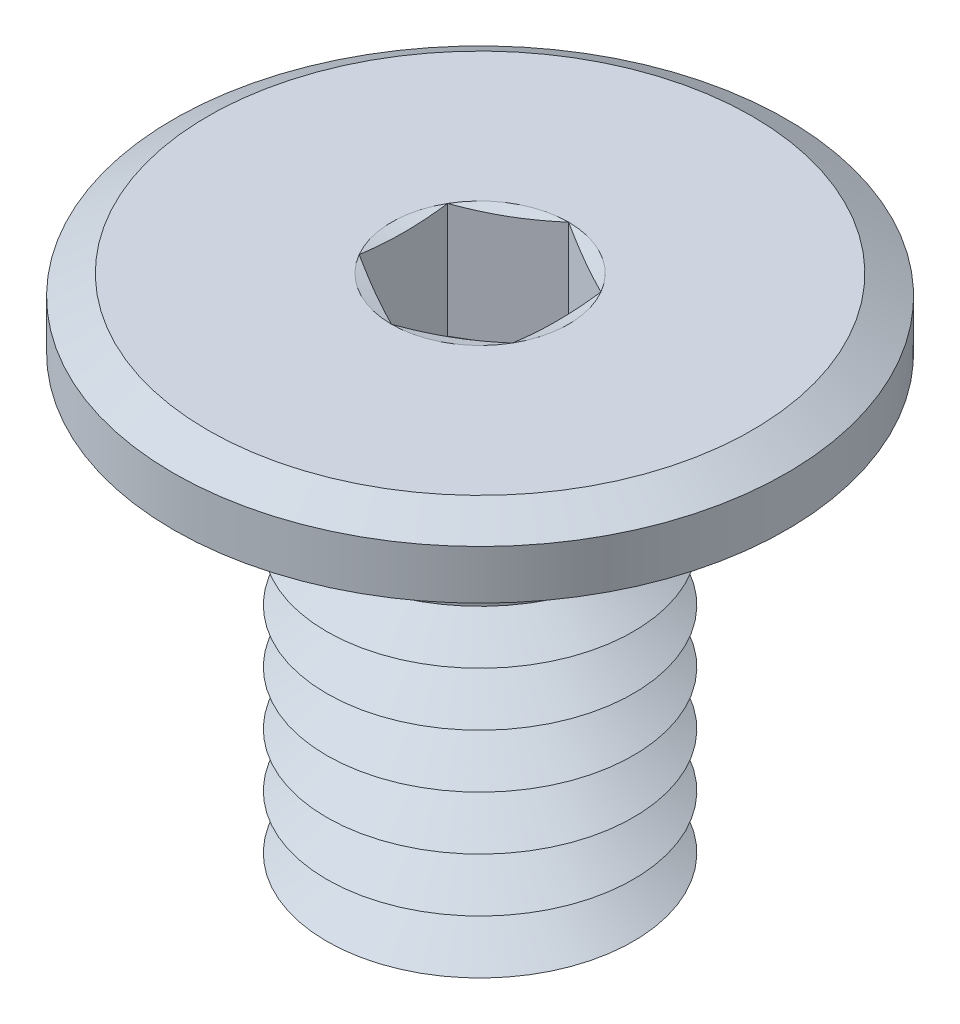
ISO-10303-21;
HEADER;
FILE_DESCRIPTION(('STEP AP214'),'2;1');
FILE_NAME('part.step','',(''),(''),'','','');
FILE_SCHEMA(('AUTOMOTIVE_DESIGN { 1 0 10303 214 1 1 1 1 }'));
ENDSEC;
DATA;
#1=APPLICATION_CONTEXT('core data for automotive mechanical design processes');
#2=APPLICATION_PROTOCOL_DEFINITION('international standard','automotive_design',2000,#1);
#3=PRODUCT_CONTEXT('',#1,'mechanical');
#4=PRODUCT('Part','Part','',(#3));
#5=PRODUCT_RELATED_PRODUCT_CATEGORY('part','',(#4));
#6=PRODUCT_DEFINITION_FORMATION('','',#4);
#7=PRODUCT_DEFINITION_CONTEXT('part definition',#1,'design');
#8=PRODUCT_DEFINITION('design','',#6,#7);
#9=PRODUCT_DEFINITION_SHAPE('','',#8);
#10=(LENGTH_UNIT() NAMED_UNIT(*) SI_UNIT(.MILLI.,.METRE.));
#11=(NAMED_UNIT(*) PLANE_ANGLE_UNIT() SI_UNIT($,.RADIAN.));
#12=(NAMED_UNIT(*) SI_UNIT($,.STERADIAN.) SOLID_ANGLE_UNIT());
#13=UNCERTAINTY_MEASURE_WITH_UNIT(LENGTH_MEASURE(1.E-05),#10,'distance_accuracy_value','');
#14=(GEOMETRIC_REPRESENTATION_CONTEXT(3) GLOBAL_UNCERTAINTY_ASSIGNED_CONTEXT((#13)) GLOBAL_UNIT_ASSIGNED_CONTEXT((#10,
#11,#12)) REPRESENTATION_CONTEXT('',''));
#15=CARTESIAN_POINT('',(0.,0.,0.));
#16=DIRECTION('',(0.,0.,1.));
#17=DIRECTION('',(1.,0.,0.));
#18=AXIS2_PLACEMENT_3D('',#15,#16,#17);
#19=CARTESIAN_POINT('',(0.,-5.85,0.));
#20=DIRECTION('',(0.,-1.,0.));
#21=DIRECTION('',(0.,0.,-1.));
#22=AXIS2_PLACEMENT_3D('',#19,#20,#21);
#23=CONICAL_SURFACE('',#22,2.,1.0471975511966);
#24=CARTESIAN_POINT('',(0.,-5.5,0.));
#25=DIRECTION('',(0.,1.,0.));
#26=DIRECTION('',(0.,0.,1.));
#27=AXIS2_PLACEMENT_3D('',#24,#25,#26);
#28=CIRCLE('',#27,1.39378221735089);
#29=CARTESIAN_POINT('',(0.,-5.5,1.39378221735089));
#30=VERTEX_POINT('',#29);
#31=EDGE_CURVE('E410',#30,#30,#28,.T.);
#32=ORIENTED_EDGE('',*,*,#31,.F.);
#33=EDGE_LOOP('',(#32));
#34=FACE_BOUND('',#33,.T.);
#35=CARTESIAN_POINT('',(0.,-5.85,0.));
#36=DIRECTION('',(0.,1.,0.));
#37=DIRECTION('',(0.,0.,1.));
#38=AXIS2_PLACEMENT_3D('',#35,#36,#37);
#39=CIRCLE('',#38,2.);
#40=CARTESIAN_POINT('',(0.,-5.85,2.));
#41=VERTEX_POINT('',#40);
#42=EDGE_CURVE('E414',#41,#41,#39,.T.);
#43=ORIENTED_EDGE('',*,*,#42,.T.);
#44=EDGE_LOOP('',(#43));
#45=FACE_BOUND('',#44,.T.);
#46=ADVANCED_FACE('F39',(#34,#45),#23,.T.);
#47=CARTESIAN_POINT('',(0.,-5.5,0.));
#48=DIRECTION('',(0.,1.,0.));
#49=DIRECTION('',(0.,0.,1.));
#50=AXIS2_PLACEMENT_3D('',#47,#48,#49);
#51=CONICAL_SURFACE('',#50,1.39378221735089,1.0471975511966);
#52=CARTESIAN_POINT('',(0.,-5.15,0.));
#53=DIRECTION('',(0.,1.,0.));
#54=DIRECTION('',(0.,0.,1.));
#55=AXIS2_PLACEMENT_3D('',#52,#53,#54);
#56=CIRCLE('',#55,2.);
#57=CARTESIAN_POINT('',(0.,-5.15,2.));
#58=VERTEX_POINT('',#57);
#59=EDGE_CURVE('E406',#58,#58,#56,.T.);
#60=ORIENTED_EDGE('',*,*,#59,.F.);
#61=EDGE_LOOP('',(#60));
#62=FACE_BOUND('',#61,.T.);
#63=ORIENTED_EDGE('',*,*,#31,.T.);
#64=EDGE_LOOP('',(#63));
#65=FACE_BOUND('',#64,.T.);
#66=ADVANCED_FACE('F233',(#62,#65),#51,.T.);
#67=CARTESIAN_POINT('',(0.,-6.9,0.));
#68=DIRECTION('',(0.,-1.,0.));
#69=DIRECTION('',(0.,0.,-1.));
#70=AXIS2_PLACEMENT_3D('',#67,#68,#69);
#71=PLANE('',#70);
#72=CARTESIAN_POINT('',(0.,-6.9,0.));
#73=DIRECTION('',(0.,1.,0.));
#74=DIRECTION('',(0.,0.,1.));
#75=AXIS2_PLACEMENT_3D('',#72,#73,#74);
#76=CIRCLE('',#75,1.39378221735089);
#77=CARTESIAN_POINT('',(0.,-6.9,1.39378221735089));
#78=VERTEX_POINT('',#77);
#79=EDGE_CURVE('E299',#78,#78,#76,.T.);
#80=ORIENTED_EDGE('',*,*,#79,.F.);
#81=EDGE_LOOP('',(#80));
#82=FACE_BOUND('',#81,.T.);
#83=ADVANCED_FACE('F239',(#82),#71,.T.);
#84=CARTESIAN_POINT('',(0.,-6.9,0.));
#85=DIRECTION('',(0.,1.,0.));
#86=DIRECTION('',(0.,0.,1.));
#87=AXIS2_PLACEMENT_3D('',#84,#85,#86);
#88=CONICAL_SURFACE('',#87,1.39378221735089,1.0471975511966);
#89=CARTESIAN_POINT('',(0.,-6.55,0.));
#90=DIRECTION('',(0.,1.,0.));
#91=DIRECTION('',(0.,0.,1.));
#92=AXIS2_PLACEMENT_3D('',#89,#90,#91);
#93=CIRCLE('',#92,2.);
#94=CARTESIAN_POINT('',(0.,-6.55,2.));
#95=VERTEX_POINT('',#94);
#96=EDGE_CURVE('E422',#95,#95,#93,.T.);
#97=ORIENTED_EDGE('',*,*,#96,.F.);
#98=EDGE_LOOP('',(#97));
#99=FACE_BOUND('',#98,.T.);
#100=ORIENTED_EDGE('',*,*,#79,.T.);
#101=EDGE_LOOP('',(#100));
#102=FACE_BOUND('',#101,.T.);
#103=ADVANCED_FACE('F254',(#99,#102),#88,.T.);
#104=CARTESIAN_POINT('',(0.,-6.55,0.));
#105=DIRECTION('',(0.,-1.,0.));
#106=DIRECTION('',(0.,0.,-1.));
#107=AXIS2_PLACEMENT_3D('',#104,#105,#106);
#108=CONICAL_SURFACE('',#107,2.,1.0471975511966);
#109=CARTESIAN_POINT('',(0.,-6.2,0.));
#110=DIRECTION('',(0.,1.,0.));
#111=DIRECTION('',(0.,0.,1.));
#112=AXIS2_PLACEMENT_3D('',#109,#110,#111);
#113=CIRCLE('',#112,1.39378221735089);
#114=CARTESIAN_POINT('',(0.,-6.2,1.39378221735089));
#115=VERTEX_POINT('',#114);
#116=EDGE_CURVE('E418',#115,#115,#113,.T.);
#117=ORIENTED_EDGE('',*,*,#116,.F.);
#118=EDGE_LOOP('',(#117));
#119=FACE_BOUND('',#118,.T.);
#120=ORIENTED_EDGE('',*,*,#96,.T.);
#121=EDGE_LOOP('',(#120));
#122=FACE_BOUND('',#121,.T.);
#123=ADVANCED_FACE('F250',(#119,#122),#108,.T.);
#124=CARTESIAN_POINT('',(0.,-6.2,0.));
#125=DIRECTION('',(0.,1.,0.));
#126=DIRECTION('',(0.,0.,1.));
#127=AXIS2_PLACEMENT_3D('',#124,#125,#126);
#128=CONICAL_SURFACE('',#127,1.39378221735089,1.0471975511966);
#129=ORIENTED_EDGE('',*,*,#42,.F.);
#130=EDGE_LOOP('',(#129));
#131=FACE_BOUND('',#130,.T.);
#132=ORIENTED_EDGE('',*,*,#116,.T.);
#133=EDGE_LOOP('',(#132));
#134=FACE_BOUND('',#133,.T.);
#135=ADVANCED_FACE('F246',(#131,#134),#128,.T.);
#136=CARTESIAN_POINT('',(0.,-5.15,0.));
#137=DIRECTION('',(0.,-1.,0.));
#138=DIRECTION('',(0.,0.,-1.));
#139=AXIS2_PLACEMENT_3D('',#136,#137,#138);
#140=CONICAL_SURFACE('',#139,2.,1.0471975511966);
#141=CARTESIAN_POINT('',(0.,-4.8,0.));
#142=DIRECTION('',(0.,1.,0.));
#143=DIRECTION('',(0.,0.,1.));
#144=AXIS2_PLACEMENT_3D('',#141,#142,#143);
#145=CIRCLE('',#144,1.39378221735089);
#146=CARTESIAN_POINT('',(0.,-4.8,1.39378221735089));
#147=VERTEX_POINT('',#146);
#148=EDGE_CURVE('E403',#147,#147,#145,.T.);
#149=ORIENTED_EDGE('',*,*,#148,.F.);
#150=EDGE_LOOP('',(#149));
#151=FACE_BOUND('',#150,.T.);
#152=ORIENTED_EDGE('',*,*,#59,.T.);
#153=EDGE_LOOP('',(#152));
#154=FACE_BOUND('',#153,.T.);
#155=ADVANCED_FACE('F249',(#151,#154),#140,.T.);
#156=CARTESIAN_POINT('',(0.,-4.8,0.));
#157=DIRECTION('',(0.,1.,0.));
#158=DIRECTION('',(0.,0.,1.));
#159=AXIS2_PLACEMENT_3D('',#156,#157,#158);
#160=CONICAL_SURFACE('',#159,1.39378221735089,1.0471975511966);
#161=CARTESIAN_POINT('',(0.,-4.45,0.));
#162=DIRECTION('',(0.,1.,0.));
#163=DIRECTION('',(0.,0.,1.));
#164=AXIS2_PLACEMENT_3D('',#161,#162,#163);
#165=CIRCLE('',#164,2.);
#166=CARTESIAN_POINT('',(0.,-4.45,2.));
#167=VERTEX_POINT('',#166);
#168=EDGE_CURVE('E399',#167,#167,#165,.T.);
#169=ORIENTED_EDGE('',*,*,#168,.F.);
#170=EDGE_LOOP('',(#169));
#171=FACE_BOUND('',#170,.T.);
#172=ORIENTED_EDGE('',*,*,#148,.T.);
#173=EDGE_LOOP('',(#172));
#174=FACE_BOUND('',#173,.T.);
#175=ADVANCED_FACE('F506',(#171,#174),#160,.T.);
#176=CARTESIAN_POINT('',(0.,-4.45,0.));
#177=DIRECTION('',(0.,-1.,0.));
#178=DIRECTION('',(0.,0.,-1.));
#179=AXIS2_PLACEMENT_3D('',#176,#177,#178);
#180=CONICAL_SURFACE('',#179,2.,1.0471975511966);
#181=CARTESIAN_POINT('',(0.,-4.1,0.));
#182=DIRECTION('',(0.,1.,0.));
#183=DIRECTION('',(0.,0.,1.));
#184=AXIS2_PLACEMENT_3D('',#181,#182,#183);
#185=CIRCLE('',#184,1.39378221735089);
#186=CARTESIAN_POINT('',(0.,-4.1,1.39378221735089));
#187=VERTEX_POINT('',#186);
#188=EDGE_CURVE('E396',#187,#187,#185,.T.);
#189=ORIENTED_EDGE('',*,*,#188,.F.);
#190=EDGE_LOOP('',(#189));
#191=FACE_BOUND('',#190,.T.);
#192=ORIENTED_EDGE('',*,*,#168,.T.);
#193=EDGE_LOOP('',(#192));
#194=FACE_BOUND('',#193,.T.);
#195=ADVANCED_FACE('F502',(#191,#194),#180,.T.);
#196=CARTESIAN_POINT('',(0.,-4.1,0.));
#197=DIRECTION('',(0.,1.,0.));
#198=DIRECTION('',(0.,0.,1.));
#199=AXIS2_PLACEMENT_3D('',#196,#197,#198);
#200=CONICAL_SURFACE('',#199,1.39378221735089,1.0471975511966);
#201=CARTESIAN_POINT('',(0.,-3.75,0.));
#202=DIRECTION('',(0.,1.,0.));
#203=DIRECTION('',(0.,0.,1.));
#204=AXIS2_PLACEMENT_3D('',#201,#202,#203);
#205=CIRCLE('',#204,2.);
#206=CARTESIAN_POINT('',(0.,-3.75,2.));
#207=VERTEX_POINT('',#206);
#208=EDGE_CURVE('E392',#207,#207,#205,.T.);
#209=ORIENTED_EDGE('',*,*,#208,.F.);
#210=EDGE_LOOP('',(#209));
#211=FACE_BOUND('',#210,.T.);
#212=ORIENTED_EDGE('',*,*,#188,.T.);
#213=EDGE_LOOP('',(#212));
#214=FACE_BOUND('',#213,.T.);
#215=ADVANCED_FACE('F498',(#211,#214),#200,.T.);
#216=CARTESIAN_POINT('',(0.,-3.75,0.));
#217=DIRECTION('',(0.,-1.,0.));
#218=DIRECTION('',(0.,0.,-1.));
#219=AXIS2_PLACEMENT_3D('',#216,#217,#218);
#220=CONICAL_SURFACE('',#219,2.,1.0471975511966);
#221=CARTESIAN_POINT('',(0.,-3.4,0.));
#222=DIRECTION('',(0.,1.,0.));
#223=DIRECTION('',(0.,0.,1.));
#224=AXIS2_PLACEMENT_3D('',#221,#222,#223);
#225=CIRCLE('',#224,1.39378221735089);
#226=CARTESIAN_POINT('',(0.,-3.4,1.39378221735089));
#227=VERTEX_POINT('',#226);
#228=EDGE_CURVE('E388',#227,#227,#225,.T.);
#229=ORIENTED_EDGE('',*,*,#228,.F.);
#230=EDGE_LOOP('',(#229));
#231=FACE_BOUND('',#230,.T.);
#232=ORIENTED_EDGE('',*,*,#208,.T.);
#233=EDGE_LOOP('',(#232));
#234=FACE_BOUND('',#233,.T.);
#235=ADVANCED_FACE('F494',(#231,#234),#220,.T.);
#236=CARTESIAN_POINT('',(0.,-3.4,0.));
#237=DIRECTION('',(0.,1.,0.));
#238=DIRECTION('',(0.,0.,1.));
#239=AXIS2_PLACEMENT_3D('',#236,#237,#238);
#240=CONICAL_SURFACE('',#239,1.39378221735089,1.0471975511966);
#241=CARTESIAN_POINT('',(0.,-3.05,0.));
#242=DIRECTION('',(0.,1.,0.));
#243=DIRECTION('',(0.,0.,1.));
#244=AXIS2_PLACEMENT_3D('',#241,#242,#243);
#245=CIRCLE('',#244,2.);
#246=CARTESIAN_POINT('',(0.,-3.05,2.));
#247=VERTEX_POINT('',#246);
#248=EDGE_CURVE('E384',#247,#247,#245,.T.);
#249=ORIENTED_EDGE('',*,*,#248,.F.);
#250=EDGE_LOOP('',(#249));
#251=FACE_BOUND('',#250,.T.);
#252=ORIENTED_EDGE('',*,*,#228,.T.);
#253=EDGE_LOOP('',(#252));
#254=FACE_BOUND('',#253,.T.);
#255=ADVANCED_FACE('F490',(#251,#254),#240,.T.);
#256=CARTESIAN_POINT('',(0.,-3.05,0.));
#257=DIRECTION('',(0.,-1.,0.));
#258=DIRECTION('',(0.,0.,-1.));
#259=AXIS2_PLACEMENT_3D('',#256,#257,#258);
#260=CONICAL_SURFACE('',#259,2.,1.0471975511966);
#261=CARTESIAN_POINT('',(0.,-2.7,0.));
#262=DIRECTION('',(0.,1.,0.));
#263=DIRECTION('',(0.,0.,1.));
#264=AXIS2_PLACEMENT_3D('',#261,#262,#263);
#265=CIRCLE('',#264,1.39378221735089);
#266=CARTESIAN_POINT('',(0.,-2.7,1.39378221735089));
#267=VERTEX_POINT('',#266);
#268=EDGE_CURVE('E380',#267,#267,#265,.T.);
#269=ORIENTED_EDGE('',*,*,#268,.F.);
#270=EDGE_LOOP('',(#269));
#271=FACE_BOUND('',#270,.T.);
#272=ORIENTED_EDGE('',*,*,#248,.T.);
#273=EDGE_LOOP('',(#272));
#274=FACE_BOUND('',#273,.T.);
#275=ADVANCED_FACE('F486',(#271,#274),#260,.T.);
#276=CARTESIAN_POINT('',(0.,-2.7,0.));
#277=DIRECTION('',(0.,1.,0.));
#278=DIRECTION('',(0.,0.,1.));
#279=AXIS2_PLACEMENT_3D('',#276,#277,#278);
#280=CONICAL_SURFACE('',#279,1.39378221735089,1.0471975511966);
#281=CARTESIAN_POINT('',(0.,-2.35,0.));
#282=DIRECTION('',(0.,1.,0.));
#283=DIRECTION('',(0.,0.,1.));
#284=AXIS2_PLACEMENT_3D('',#281,#282,#283);
#285=CIRCLE('',#284,2.);
#286=CARTESIAN_POINT('',(0.,-2.35,2.));
#287=VERTEX_POINT('',#286);
#288=EDGE_CURVE('E366',#287,#287,#285,.T.);
#289=ORIENTED_EDGE('',*,*,#288,.F.);
#290=EDGE_LOOP('',(#289));
#291=FACE_BOUND('',#290,.T.);
#292=ORIENTED_EDGE('',*,*,#268,.T.);
#293=EDGE_LOOP('',(#292));
#294=FACE_BOUND('',#293,.T.);
#295=ADVANCED_FACE('F274',(#291,#294),#280,.T.);
#296=CARTESIAN_POINT('',(0.,0.,0.));
#297=DIRECTION('',(0.,1.,0.));
#298=DIRECTION('',(0.,0.,1.));
#299=AXIS2_PLACEMENT_3D('',#296,#297,#298);
#300=PLANE('',#299);
#301=CARTESIAN_POINT('',(0.,0.,0.));
#302=DIRECTION('',(0.,1.,0.));
#303=DIRECTION('',(0.,0.,1.));
#304=AXIS2_PLACEMENT_3D('',#301,#302,#303);
#305=CIRCLE('',#304,1.15470053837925);
#306=CARTESIAN_POINT('',(0.,0.,1.15470053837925));
#307=VERTEX_POINT('',#306);
#308=CARTESIAN_POINT('',(1.,0.,0.577350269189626));
#309=VERTEX_POINT('',#308);
#310=EDGE_CURVE('E66',#307,#309,#305,.T.);
#311=ORIENTED_EDGE('',*,*,#310,.F.);
#312=CARTESIAN_POINT('',(-1.,0.,0.577350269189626));
#313=VERTEX_POINT('',#312);
#314=EDGE_CURVE('E169',#313,#307,#305,.T.);
#315=ORIENTED_EDGE('',*,*,#314,.F.);
#316=CARTESIAN_POINT('',(-1.,0.,-0.577350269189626));
#317=VERTEX_POINT('',#316);
#318=EDGE_CURVE('E164',#317,#313,#305,.T.);
#319=ORIENTED_EDGE('',*,*,#318,.F.);
#320=CARTESIAN_POINT('',(0.,0.,-1.15470053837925));
#321=VERTEX_POINT('',#320);
#322=EDGE_CURVE('E128',#321,#317,#305,.T.);
#323=ORIENTED_EDGE('',*,*,#322,.F.);
#324=CARTESIAN_POINT('',(1.,0.,-0.577350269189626));
#325=VERTEX_POINT('',#324);
#326=EDGE_CURVE('E119',#325,#321,#305,.T.);
#327=ORIENTED_EDGE('',*,*,#326,.F.);
#328=EDGE_CURVE('E59',#309,#325,#305,.T.);
#329=ORIENTED_EDGE('',*,*,#328,.F.);
#330=EDGE_LOOP('',(#311,#315,#319,#323,#327,#329));
#331=FACE_BOUND('',#330,.T.);
#332=CARTESIAN_POINT('',(0.,0.,0.));
#333=DIRECTION('',(0.,1.,0.));
#334=DIRECTION('',(0.,0.,1.));
#335=AXIS2_PLACEMENT_3D('',#332,#333,#334);
#336=CIRCLE('',#335,3.55);
#337=CARTESIAN_POINT('',(0.,0.,3.55));
#338=VERTEX_POINT('',#337);
#339=EDGE_CURVE('E295',#338,#338,#336,.T.);
#340=ORIENTED_EDGE('',*,*,#339,.T.);
#341=EDGE_LOOP('',(#340));
#342=FACE_BOUND('',#341,.T.);
#343=ADVANCED_FACE('F160',(#331,#342),#300,.T.);
#344=CARTESIAN_POINT('',(0.,-0.9,0.));
#345=DIRECTION('',(0.,1.,0.));
#346=DIRECTION('',(0.,0.,1.));
#347=AXIS2_PLACEMENT_3D('',#344,#345,#346);
#348=CYLINDRICAL_SURFACE('',#347,4.);
#349=CARTESIAN_POINT('',(0.,-0.259807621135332,0.));
#350=DIRECTION('',(0.,1.,0.));
#351=DIRECTION('',(0.,0.,1.));
#352=AXIS2_PLACEMENT_3D('',#349,#350,#351);
#353=CIRCLE('',#352,4.);
#354=CARTESIAN_POINT('',(0.,-0.259807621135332,4.));
#355=VERTEX_POINT('',#354);
#356=EDGE_CURVE('E306',#355,#355,#353,.F.);
#357=ORIENTED_EDGE('',*,*,#356,.T.);
#358=EDGE_LOOP('',(#357));
#359=FACE_BOUND('',#358,.T.);
#360=CARTESIAN_POINT('',(0.,-0.9,0.));
#361=DIRECTION('',(0.,1.,0.));
#362=DIRECTION('',(0.,0.,1.));
#363=AXIS2_PLACEMENT_3D('',#360,#361,#362);
#364=CIRCLE('',#363,4.);
#365=CARTESIAN_POINT('',(0.,-0.9,4.));
#366=VERTEX_POINT('',#365);
#367=EDGE_CURVE('E291',#366,#366,#364,.T.);
#368=ORIENTED_EDGE('',*,*,#367,.T.);
#369=EDGE_LOOP('',(#368));
#370=FACE_BOUND('',#369,.T.);
#371=ADVANCED_FACE('F270',(#359,#370),#348,.T.);
#372=CARTESIAN_POINT('',(0.,-0.9,0.));
#373=DIRECTION('',(0.,1.,0.));
#374=DIRECTION('',(0.,0.,1.));
#375=AXIS2_PLACEMENT_3D('',#372,#373,#374);
#376=PLANE('',#375);
#377=CARTESIAN_POINT('',(0.,-0.9,0.));
#378=DIRECTION('',(0.,1.,0.));
#379=DIRECTION('',(0.,0.,1.));
#380=AXIS2_PLACEMENT_3D('',#377,#378,#379);
#381=CIRCLE('',#380,2.2);
#382=CARTESIAN_POINT('',(0.,-0.9,2.2));
#383=VERTEX_POINT('',#382);
#384=EDGE_CURVE('E286',#383,#383,#381,.T.);
#385=ORIENTED_EDGE('',*,*,#384,.T.);
#386=EDGE_LOOP('',(#385));
#387=FACE_BOUND('',#386,.T.);
#388=ORIENTED_EDGE('',*,*,#367,.F.);
#389=EDGE_LOOP('',(#388));
#390=FACE_BOUND('',#389,.T.);
#391=ADVANCED_FACE('F266',(#387,#390),#376,.F.);
#392=CARTESIAN_POINT('',(0.,-6.9,0.));
#393=DIRECTION('',(0.,1.,0.));
#394=DIRECTION('',(0.,0.,1.));
#395=AXIS2_PLACEMENT_3D('',#392,#393,#394);
#396=CYLINDRICAL_SURFACE('',#395,2.);
#397=CARTESIAN_POINT('',(0.,-1.1,0.));
#398=DIRECTION('',(0.,1.,0.));
#399=DIRECTION('',(0.,0.,1.));
#400=AXIS2_PLACEMENT_3D('',#397,#398,#399);
#401=CIRCLE('',#400,2.);
#402=CARTESIAN_POINT('',(0.,-1.1,2.));
#403=VERTEX_POINT('',#402);
#404=EDGE_CURVE('E289',#403,#403,#401,.F.);
#405=ORIENTED_EDGE('',*,*,#404,.T.);
#406=EDGE_LOOP('',(#405));
#407=FACE_BOUND('',#406,.T.);
#408=ORIENTED_EDGE('',*,*,#288,.T.);
#409=EDGE_LOOP('',(#408));
#410=FACE_BOUND('',#409,.T.);
#411=ADVANCED_FACE('F262',(#407,#410),#396,.T.);
#412=CARTESIAN_POINT('',(0.,-1.1,0.));
#413=DIRECTION('',(0.,1.,0.));
#414=DIRECTION('',(0.,0.,1.));
#415=AXIS2_PLACEMENT_3D('',#412,#413,#414);
#416=TOROIDAL_SURFACE('',#415,2.2,0.2);
#417=ORIENTED_EDGE('',*,*,#384,.F.);
#418=EDGE_LOOP('',(#417));
#419=FACE_BOUND('',#418,.T.);
#420=ORIENTED_EDGE('',*,*,#404,.F.);
#421=EDGE_LOOP('',(#420));
#422=FACE_BOUND('',#421,.T.);
#423=ADVANCED_FACE('F265',(#419,#422),#416,.F.);
#424=CARTESIAN_POINT('',(0.,0.,0.));
#425=DIRECTION('',(0.,-1.,0.));
#426=DIRECTION('',(0.,0.,-1.));
#427=AXIS2_PLACEMENT_3D('',#424,#425,#426);
#428=CONICAL_SURFACE('',#427,3.55,1.0471975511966);
#429=ORIENTED_EDGE('',*,*,#356,.F.);
#430=EDGE_LOOP('',(#429));
#431=FACE_BOUND('',#430,.T.);
#432=ORIENTED_EDGE('',*,*,#339,.F.);
#433=EDGE_LOOP('',(#432));
#434=FACE_BOUND('',#433,.T.);
#435=ADVANCED_FACE('F41',(#431,#434),#428,.T.);
#436=CARTESIAN_POINT('',(0.,0.,0.));
#437=DIRECTION('',(0.,1.,0.));
#438=DIRECTION('',(0.,0.,1.));
#439=AXIS2_PLACEMENT_3D('',#436,#437,#438);
#440=CONICAL_SURFACE('',#439,1.15470053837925,1.30899693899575);
#441=ORIENTED_EDGE('',*,*,#322,.T.);
#442=CARTESIAN_POINT('',(0.000200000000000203,3.09447482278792E-05,-1.15481600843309));
#443=CARTESIAN_POINT('',(-0.0413440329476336,-0.00640029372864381,-1.13083054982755));
#444=CARTESIAN_POINT('',(-0.0829634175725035,-0.012238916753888,-1.10680158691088));
#445=CARTESIAN_POINT('',(-0.166349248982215,-0.0224969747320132,-1.05865875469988));
#446=CARTESIAN_POINT('',(-0.208115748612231,-0.0269158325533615,-1.03454485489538));
#447=CARTESIAN_POINT('',(-0.291542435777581,-0.0340762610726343,-0.986378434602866));
#448=CARTESIAN_POINT('',(-0.333202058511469,-0.0368263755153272,-0.962326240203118));
#449=CARTESIAN_POINT('',(-0.416574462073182,-0.0405140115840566,-0.914191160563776));
#450=CARTESIAN_POINT('',(-0.458287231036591,-0.0414518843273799,-0.890108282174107));
#451=CARTESIAN_POINT('',(-0.541712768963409,-0.0414518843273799,-0.84194252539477));
#452=CARTESIAN_POINT('',(-0.583425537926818,-0.0405140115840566,-0.817859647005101));
#453=CARTESIAN_POINT('',(-0.666797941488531,-0.0368263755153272,-0.76972456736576));
#454=CARTESIAN_POINT('',(-0.708457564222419,-0.0340762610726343,-0.745672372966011));
#455=CARTESIAN_POINT('',(-0.791884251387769,-0.0269158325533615,-0.697505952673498));
#456=CARTESIAN_POINT('',(-0.833650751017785,-0.0224969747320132,-0.673392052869));
#457=CARTESIAN_POINT('',(-0.917036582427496,-0.012238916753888,-0.625249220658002));
#458=CARTESIAN_POINT('',(-0.958655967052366,-0.00640029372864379,-0.601220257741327));
#459=CARTESIAN_POINT('',(-1.0002,3.09447482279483E-05,-0.577234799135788));
#460=B_SPLINE_CURVE_WITH_KNOTS('',3,(#442,#443,#444,#445,#446,#447,#448,#449,#450,#451,#452,
#453,#454,#455,#456,#457,#458,#459),.UNSPECIFIED.,.F.,.F.,(4,2,2,2,2,2,2,2,4),(0.,
0.145207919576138,0.290474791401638,0.434991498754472,0.579480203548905,0.723968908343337,
0.868485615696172,1.01375248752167,1.15896040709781),.UNSPECIFIED.);
#461=EDGE_CURVE('E11',#321,#317,#460,.T.);
#462=ORIENTED_EDGE('',*,*,#461,.F.);
#463=EDGE_LOOP('',(#441,#462));
#464=FACE_BOUND('',#463,.T.);
#465=ADVANCED_FACE('F132',(#464),#440,.F.);
#466=ORIENTED_EDGE('',*,*,#318,.T.);
#467=CARTESIAN_POINT('',(-1.,0.236023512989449,-1.77298423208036));
#468=CARTESIAN_POINT('',(-1.,0.216107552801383,-1.6875314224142));
#469=CARTESIAN_POINT('',(-1.,0.196471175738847,-1.60200905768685));
#470=CARTESIAN_POINT('',(-1.,0.158144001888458,-1.43073686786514));
#471=CARTESIAN_POINT('',(-1.,0.139453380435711,-1.34498700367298));
#472=CARTESIAN_POINT('',(-1.,0.1032364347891,-1.17236724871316));
#473=CARTESIAN_POINT('',(-1.,0.0857232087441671,-1.08549457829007));
#474=CARTESIAN_POINT('',(-1.,0.0527507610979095,-0.911344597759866));
#475=CARTESIAN_POINT('',(-1.,0.0372917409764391,-0.824067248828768));
#476=CARTESIAN_POINT('',(-1.,0.00985747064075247,-0.651412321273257));
#477=CARTESIAN_POINT('',(-1.,-0.00220187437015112,-0.566048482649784));
#478=CARTESIAN_POINT('',(-1.,-0.0220616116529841,-0.394830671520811));
#479=CARTESIAN_POINT('',(-1.,-0.0298633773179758,-0.308976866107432));
#480=CARTESIAN_POINT('',(-1.,-0.0398601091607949,-0.137316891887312));
#481=CARTESIAN_POINT('',(-1.,-0.0420806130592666,-0.0515123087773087));
#482=CARTESIAN_POINT('',(-1.,-0.0405086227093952,0.120045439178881));
#483=CARTESIAN_POINT('',(-1.,-0.0367157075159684,0.20579860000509));
#484=CARTESIAN_POINT('',(-1.,-0.0256781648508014,0.353235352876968));
#485=CARTESIAN_POINT('',(-1.,-0.0196775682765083,0.415019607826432));
#486=CARTESIAN_POINT('',(-1.,-0.00545724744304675,0.538326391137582));
#487=CARTESIAN_POINT('',(-1.,0.00276242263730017,0.599848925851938));
#488=CARTESIAN_POINT('',(-1.,0.0300253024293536,0.784439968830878));
#489=CARTESIAN_POINT('',(-1.,0.0516350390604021,0.907124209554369));
#490=CARTESIAN_POINT('',(-1.,0.0871575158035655,1.09186138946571));
#491=CARTESIAN_POINT('',(-1.,0.0996614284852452,1.15420316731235));
#492=CARTESIAN_POINT('',(-1.,0.125434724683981,1.27873123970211));
#493=CARTESIAN_POINT('',(-1.,0.138704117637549,1.34091753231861));
#494=CARTESIAN_POINT('',(-1.,0.165737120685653,1.4648085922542));
#495=CARTESIAN_POINT('',(-1.,0.179497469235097,1.5265140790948));
#496=CARTESIAN_POINT('',(-1.,0.207459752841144,1.64982040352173));
#497=CARTESIAN_POINT('',(-1.,0.221661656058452,1.71142124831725));
#498=CARTESIAN_POINT('',(-1.,0.236023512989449,1.77298423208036));
#499=B_SPLINE_CURVE_WITH_KNOTS('',3,(#467,#468,#469,#470,#471,#472,#473,#474,#475,#476,#477,
#478,#479,#480,#481,#482,#483,#484,#485,#486,#487,#488,#489,#490,#491,#492,#493,#494,#495,#496,
#497,#498),.UNSPECIFIED.,.F.,.F.,(4,2,2,2,2,2,2,2,2,2,2,2,2,2,2,4),(0.,0.263234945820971,
0.52651851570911,0.792363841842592,1.0582352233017,1.31679695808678,1.5752752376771,
1.83256864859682,2.08988007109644,2.27606085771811,2.462237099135,2.83581575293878,
3.02656672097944,3.21732004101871,3.40698211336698,3.59663054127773),.UNSPECIFIED.);
#500=EDGE_CURVE('E172',#317,#313,#499,.T.);
#501=ORIENTED_EDGE('',*,*,#500,.F.);
#502=EDGE_LOOP('',(#466,#501));
#503=FACE_BOUND('',#502,.T.);
#504=ADVANCED_FACE('F570',(#503),#440,.F.);
#505=ORIENTED_EDGE('',*,*,#314,.T.);
#506=CARTESIAN_POINT('',(-1.0002,3.09447482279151E-05,0.577234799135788));
#507=CARTESIAN_POINT('',(-0.958655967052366,-0.00640029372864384,0.601220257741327));
#508=CARTESIAN_POINT('',(-0.917036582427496,-0.012238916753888,0.625249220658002));
#509=CARTESIAN_POINT('',(-0.833650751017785,-0.0224969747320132,0.673392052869));
#510=CARTESIAN_POINT('',(-0.791884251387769,-0.0269158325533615,0.697505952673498));
#511=CARTESIAN_POINT('',(-0.708457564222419,-0.0340762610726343,0.745672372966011));
#512=CARTESIAN_POINT('',(-0.666797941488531,-0.0368263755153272,0.76972456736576));
#513=CARTESIAN_POINT('',(-0.583425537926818,-0.0405140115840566,0.817859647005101));
#514=CARTESIAN_POINT('',(-0.541712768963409,-0.0414518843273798,0.84194252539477));
#515=CARTESIAN_POINT('',(-0.458287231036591,-0.0414518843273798,0.890108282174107));
#516=CARTESIAN_POINT('',(-0.416574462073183,-0.0405140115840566,0.914191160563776));
#517=CARTESIAN_POINT('',(-0.333202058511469,-0.0368263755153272,0.962326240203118));
#518=CARTESIAN_POINT('',(-0.291542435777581,-0.0340762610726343,0.986378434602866));
#519=CARTESIAN_POINT('',(-0.208115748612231,-0.0269158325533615,1.03454485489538));
#520=CARTESIAN_POINT('',(-0.166349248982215,-0.0224969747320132,1.05865875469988));
#521=CARTESIAN_POINT('',(-0.082963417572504,-0.0122389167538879,1.10680158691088));
#522=CARTESIAN_POINT('',(-0.0413440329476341,-0.00640029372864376,1.13083054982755));
#523=CARTESIAN_POINT('',(0.000199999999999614,3.09447482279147E-05,1.15481600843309));
#524=B_SPLINE_CURVE_WITH_KNOTS('',3,(#506,#507,#508,#509,#510,#511,#512,#513,#514,#515,#516,
#517,#518,#519,#520,#521,#522,#523),.UNSPECIFIED.,.F.,.F.,(4,2,2,2,2,2,2,2,4),(0.,
0.145207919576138,0.290474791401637,0.434991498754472,0.579480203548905,0.723968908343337,
0.868485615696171,1.01375248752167,1.15896040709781),.UNSPECIFIED.);
#525=EDGE_CURVE('E180',#313,#307,#524,.T.);
#526=ORIENTED_EDGE('',*,*,#525,.F.);
#527=EDGE_LOOP('',(#505,#526));
#528=FACE_BOUND('',#527,.T.);
#529=ADVANCED_FACE('F449',(#528),#440,.F.);
#530=ORIENTED_EDGE('',*,*,#310,.T.);
#531=CARTESIAN_POINT('',(-0.000200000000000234,3.09447482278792E-05,1.15481600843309));
#532=CARTESIAN_POINT('',(0.0413440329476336,-0.00640029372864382,1.13083054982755));
#533=CARTESIAN_POINT('',(0.0829634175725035,-0.012238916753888,1.10680158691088));
#534=CARTESIAN_POINT('',(0.166349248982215,-0.0224969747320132,1.05865875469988));
#535=CARTESIAN_POINT('',(0.208115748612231,-0.0269158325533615,1.03454485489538));
#536=CARTESIAN_POINT('',(0.291542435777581,-0.0340762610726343,0.986378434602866));
#537=CARTESIAN_POINT('',(0.333202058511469,-0.0368263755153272,0.962326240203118));
#538=CARTESIAN_POINT('',(0.416574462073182,-0.0405140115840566,0.914191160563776));
#539=CARTESIAN_POINT('',(0.458287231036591,-0.0414518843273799,0.890108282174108));
#540=CARTESIAN_POINT('',(0.541712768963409,-0.0414518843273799,0.84194252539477));
#541=CARTESIAN_POINT('',(0.583425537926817,-0.0405140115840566,0.817859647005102));
#542=CARTESIAN_POINT('',(0.666797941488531,-0.0368263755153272,0.76972456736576));
#543=CARTESIAN_POINT('',(0.708457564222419,-0.0340762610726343,0.745672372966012));
#544=CARTESIAN_POINT('',(0.791884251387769,-0.0269158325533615,0.697505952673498));
#545=CARTESIAN_POINT('',(0.833650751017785,-0.0224969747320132,0.673392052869));
#546=CARTESIAN_POINT('',(0.917036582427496,-0.012238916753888,0.625249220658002));
#547=CARTESIAN_POINT('',(0.958655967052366,-0.00640029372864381,0.601220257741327));
#548=CARTESIAN_POINT('',(1.0002,3.09447482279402E-05,0.577234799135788));
#549=B_SPLINE_CURVE_WITH_KNOTS('',3,(#531,#532,#533,#534,#535,#536,#537,#538,#539,#540,#541,
#542,#543,#544,#545,#546,#547,#548),.UNSPECIFIED.,.F.,.F.,(4,2,2,2,2,2,2,2,4),(0.,
0.145207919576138,0.290474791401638,0.434991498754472,0.579480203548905,0.723968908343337,
0.868485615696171,1.01375248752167,1.15896040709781),.UNSPECIFIED.);
#550=EDGE_CURVE('E199',#307,#309,#549,.T.);
#551=ORIENTED_EDGE('',*,*,#550,.F.);
#552=EDGE_LOOP('',(#530,#551));
#553=FACE_BOUND('',#552,.T.);
#554=ADVANCED_FACE('F451',(#553),#440,.F.);
#555=ORIENTED_EDGE('',*,*,#328,.T.);
#556=CARTESIAN_POINT('',(1.,0.23602351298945,1.77298423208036));
#557=CARTESIAN_POINT('',(1.,0.216107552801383,1.6875314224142));
#558=CARTESIAN_POINT('',(1.,0.196471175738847,1.60200905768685));
#559=CARTESIAN_POINT('',(1.,0.158144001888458,1.43073686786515));
#560=CARTESIAN_POINT('',(1.,0.139453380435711,1.34498700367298));
#561=CARTESIAN_POINT('',(1.,0.1032364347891,1.17236724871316));
#562=CARTESIAN_POINT('',(1.,0.0857232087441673,1.08549457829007));
#563=CARTESIAN_POINT('',(1.,0.0527507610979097,0.911344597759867));
#564=CARTESIAN_POINT('',(1.,0.0372917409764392,0.824067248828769));
#565=CARTESIAN_POINT('',(1.,0.00985747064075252,0.651412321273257));
#566=CARTESIAN_POINT('',(1.,-0.00220187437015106,0.566048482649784));
#567=CARTESIAN_POINT('',(1.,-0.0220616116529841,0.394830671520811));
#568=CARTESIAN_POINT('',(1.,-0.0298633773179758,0.308976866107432));
#569=CARTESIAN_POINT('',(1.,-0.0398601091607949,0.137316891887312));
#570=CARTESIAN_POINT('',(1.,-0.0420806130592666,0.051512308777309));
#571=CARTESIAN_POINT('',(1.,-0.0405086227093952,-0.120045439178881));
#572=CARTESIAN_POINT('',(1.,-0.0367157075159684,-0.205798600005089));
#573=CARTESIAN_POINT('',(1.,-0.0256781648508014,-0.353235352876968));
#574=CARTESIAN_POINT('',(1.,-0.0196775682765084,-0.415019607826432));
#575=CARTESIAN_POINT('',(1.,-0.00545724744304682,-0.538326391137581));
#576=CARTESIAN_POINT('',(1.,0.00276242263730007,-0.599848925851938));
#577=CARTESIAN_POINT('',(1.,0.0300253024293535,-0.784439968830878));
#578=CARTESIAN_POINT('',(1.,0.051635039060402,-0.907124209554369));
#579=CARTESIAN_POINT('',(1.,0.0871575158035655,-1.09186138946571));
#580=CARTESIAN_POINT('',(1.,0.0996614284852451,-1.15420316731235));
#581=CARTESIAN_POINT('',(1.,0.125434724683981,-1.27873123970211));
#582=CARTESIAN_POINT('',(1.,0.138704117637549,-1.34091753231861));
#583=CARTESIAN_POINT('',(1.,0.165737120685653,-1.4648085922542));
#584=CARTESIAN_POINT('',(1.,0.179497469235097,-1.5265140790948));
#585=CARTESIAN_POINT('',(1.,0.207459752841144,-1.64982040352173));
#586=CARTESIAN_POINT('',(1.,0.221661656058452,-1.71142124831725));
#587=CARTESIAN_POINT('',(1.,0.236023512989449,-1.77298423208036));
#588=B_SPLINE_CURVE_WITH_KNOTS('',3,(#556,#557,#558,#559,#560,#561,#562,#563,#564,#565,#566,
#567,#568,#569,#570,#571,#572,#573,#574,#575,#576,#577,#578,#579,#580,#581,#582,#583,#584,#585,
#586,#587),.UNSPECIFIED.,.F.,.F.,(4,2,2,2,2,2,2,2,2,2,2,2,2,2,2,4),(0.,0.263234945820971,
0.52651851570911,0.792363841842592,1.0582352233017,1.31679695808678,1.5752752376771,
1.83256864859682,2.08988007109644,2.27606085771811,2.462237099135,2.83581575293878,
3.02656672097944,3.21732004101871,3.40698211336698,3.59663054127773),.UNSPECIFIED.);
#589=EDGE_CURVE('E149',#309,#325,#588,.T.);
#590=ORIENTED_EDGE('',*,*,#589,.F.);
#591=EDGE_LOOP('',(#555,#590));
#592=FACE_BOUND('',#591,.T.);
#593=ADVANCED_FACE('F192',(#592),#440,.F.);
#594=ORIENTED_EDGE('',*,*,#326,.T.);
#595=CARTESIAN_POINT('',(1.0002,3.09447482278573E-05,-0.577234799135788));
#596=CARTESIAN_POINT('',(0.958655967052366,-0.00640029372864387,-0.601220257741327));
#597=CARTESIAN_POINT('',(0.917036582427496,-0.012238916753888,-0.625249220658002));
#598=CARTESIAN_POINT('',(0.833650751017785,-0.0224969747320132,-0.673392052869));
#599=CARTESIAN_POINT('',(0.791884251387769,-0.0269158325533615,-0.697505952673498));
#600=CARTESIAN_POINT('',(0.708457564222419,-0.0340762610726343,-0.745672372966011));
#601=CARTESIAN_POINT('',(0.666797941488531,-0.0368263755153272,-0.76972456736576));
#602=CARTESIAN_POINT('',(0.583425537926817,-0.0405140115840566,-0.817859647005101));
#603=CARTESIAN_POINT('',(0.541712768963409,-0.0414518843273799,-0.84194252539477));
#604=CARTESIAN_POINT('',(0.458287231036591,-0.0414518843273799,-0.890108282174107));
#605=CARTESIAN_POINT('',(0.416574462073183,-0.0405140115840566,-0.914191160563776));
#606=CARTESIAN_POINT('',(0.333202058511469,-0.0368263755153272,-0.962326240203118));
#607=CARTESIAN_POINT('',(0.291542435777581,-0.0340762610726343,-0.986378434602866));
#608=CARTESIAN_POINT('',(0.208115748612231,-0.0269158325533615,-1.03454485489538));
#609=CARTESIAN_POINT('',(0.166349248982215,-0.0224969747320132,-1.05865875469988));
#610=CARTESIAN_POINT('',(0.0829634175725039,-0.012238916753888,-1.10680158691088));
#611=CARTESIAN_POINT('',(0.0413440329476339,-0.00640029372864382,-1.13083054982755));
#612=CARTESIAN_POINT('',(-0.000199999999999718,3.09447482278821E-05,-1.15481600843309));
#613=B_SPLINE_CURVE_WITH_KNOTS('',3,(#595,#596,#597,#598,#599,#600,#601,#602,#603,#604,#605,
#606,#607,#608,#609,#610,#611,#612),.UNSPECIFIED.,.F.,.F.,(4,2,2,2,2,2,2,2,4),(0.,
0.145207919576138,0.290474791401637,0.434991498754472,0.579480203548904,0.723968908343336,
0.868485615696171,1.01375248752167,1.15896040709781),.UNSPECIFIED.);
#614=EDGE_CURVE('E123',#325,#321,#613,.T.);
#615=ORIENTED_EDGE('',*,*,#614,.F.);
#616=EDGE_LOOP('',(#594,#615));
#617=FACE_BOUND('',#616,.T.);
#618=ADVANCED_FACE('F121',(#617),#440,.F.);
#619=CARTESIAN_POINT('',(0.,-1.5,0.));
#620=DIRECTION('',(0.,1.,0.));
#621=DIRECTION('',(0.,0.,1.));
#622=AXIS2_PLACEMENT_3D('',#619,#620,#621);
#623=CONICAL_SURFACE('',#622,1.,1.0471975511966);
#624=CARTESIAN_POINT('',(0.,-2.07735026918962,0.));
#625=VERTEX_POINT('',#624);
#626=VERTEX_LOOP('',#625);
#627=FACE_BOUND('',#626,.T.);
#628=CARTESIAN_POINT('',(0.,-1.5,0.));
#629=DIRECTION('',(0.,1.,0.));
#630=DIRECTION('',(0.,0.,1.));
#631=AXIS2_PLACEMENT_3D('',#628,#629,#630);
#632=CIRCLE('',#631,1.);
#633=CARTESIAN_POINT('',(0.5,-1.5,0.866025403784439));
#634=VERTEX_POINT('',#633);
#635=CARTESIAN_POINT('',(1.,-1.5,0.));
#636=VERTEX_POINT('',#635);
#637=EDGE_CURVE('E148',#634,#636,#632,.T.);
#638=ORIENTED_EDGE('',*,*,#637,.T.);
#639=CARTESIAN_POINT('',(0.,-1.5,0.));
#640=DIRECTION('',(0.,1.,0.));
#641=DIRECTION('',(0.,0.,1.));
#642=AXIS2_PLACEMENT_3D('',#639,#640,#641);
#643=CIRCLE('',#642,1.);
#644=CARTESIAN_POINT('',(0.5,-1.5,-0.866025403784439));
#645=VERTEX_POINT('',#644);
#646=EDGE_CURVE('E53',#636,#645,#643,.T.);
#647=ORIENTED_EDGE('',*,*,#646,.T.);
#648=CARTESIAN_POINT('',(-0.5,-1.5,-0.866025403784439));
#649=VERTEX_POINT('',#648);
#650=EDGE_CURVE('E319',#645,#649,#643,.T.);
#651=ORIENTED_EDGE('',*,*,#650,.T.);
#652=CARTESIAN_POINT('',(-1.,-1.5,0.));
#653=VERTEX_POINT('',#652);
#654=EDGE_CURVE('E318',#649,#653,#643,.T.);
#655=ORIENTED_EDGE('',*,*,#654,.T.);
#656=CARTESIAN_POINT('',(-0.5,-1.5,0.866025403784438));
#657=VERTEX_POINT('',#656);
#658=EDGE_CURVE('E311',#653,#657,#643,.T.);
#659=ORIENTED_EDGE('',*,*,#658,.T.);
#660=EDGE_CURVE('E309',#657,#634,#643,.T.);
#661=ORIENTED_EDGE('',*,*,#660,.T.);
#662=EDGE_LOOP('',(#638,#647,#651,#655,#659,#661));
#663=FACE_BOUND('',#662,.T.);
#664=ADVANCED_FACE('F191',(#627,#663),#623,.F.);
#665=CARTESIAN_POINT('',(0.,-1.5,0.));
#666=DIRECTION('',(0.,1.,0.));
#667=DIRECTION('',(0.,0.,1.));
#668=AXIS2_PLACEMENT_3D('',#665,#666,#667);
#669=PLANE('',#668);
#670=ORIENTED_EDGE('',*,*,#646,.F.);
#671=DIRECTION('',(0.,0.,-1.));
#672=VECTOR('',#671,1.);
#673=CARTESIAN_POINT('',(1.,-1.5,0.577350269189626));
#674=LINE('',#673,#672);
#675=CARTESIAN_POINT('',(1.,-1.5,-0.577350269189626));
#676=VERTEX_POINT('',#675);
#677=EDGE_CURVE('E360',#636,#676,#674,.T.);
#678=ORIENTED_EDGE('',*,*,#677,.T.);
#679=DIRECTION('',(-0.866025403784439,0.,-0.5));
#680=VECTOR('',#679,1.);
#681=CARTESIAN_POINT('',(1.,-1.5,-0.577350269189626));
#682=LINE('',#681,#680);
#683=EDGE_CURVE('E432',#676,#645,#682,.T.);
#684=ORIENTED_EDGE('',*,*,#683,.T.);
#685=EDGE_LOOP('',(#670,#678,#684));
#686=FACE_BOUND('',#685,.T.);
#687=ADVANCED_FACE('F439',(#686),#669,.T.);
#688=ORIENTED_EDGE('',*,*,#637,.F.);
#689=DIRECTION('',(0.866025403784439,0.,-0.5));
#690=VECTOR('',#689,1.);
#691=CARTESIAN_POINT('',(0.,-1.5,1.15470053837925));
#692=LINE('',#691,#690);
#693=CARTESIAN_POINT('',(1.,-1.5,0.577350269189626));
#694=VERTEX_POINT('',#693);
#695=EDGE_CURVE('E355',#634,#694,#692,.T.);
#696=ORIENTED_EDGE('',*,*,#695,.T.);
#697=EDGE_CURVE('E157',#694,#636,#674,.T.);
#698=ORIENTED_EDGE('',*,*,#697,.T.);
#699=EDGE_LOOP('',(#688,#696,#698));
#700=FACE_BOUND('',#699,.T.);
#701=ADVANCED_FACE('F442',(#700),#669,.T.);
#702=ORIENTED_EDGE('',*,*,#660,.F.);
#703=DIRECTION('',(0.866025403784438,0.,0.5));
#704=VECTOR('',#703,1.);
#705=CARTESIAN_POINT('',(-1.,-1.5,0.577350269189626));
#706=LINE('',#705,#704);
#707=CARTESIAN_POINT('',(0.,-1.5,1.15470053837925));
#708=VERTEX_POINT('',#707);
#709=EDGE_CURVE('E347',#657,#708,#706,.T.);
#710=ORIENTED_EDGE('',*,*,#709,.T.);
#711=EDGE_CURVE('E356',#708,#634,#692,.T.);
#712=ORIENTED_EDGE('',*,*,#711,.T.);
#713=EDGE_LOOP('',(#702,#710,#712));
#714=FACE_BOUND('',#713,.T.);
#715=ADVANCED_FACE('F220',(#714),#669,.T.);
#716=ORIENTED_EDGE('',*,*,#658,.F.);
#717=DIRECTION('',(0.,0.,1.));
#718=VECTOR('',#717,1.);
#719=CARTESIAN_POINT('',(-1.,-1.5,-0.577350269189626));
#720=LINE('',#719,#718);
#721=CARTESIAN_POINT('',(-1.,-1.5,0.577350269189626));
#722=VERTEX_POINT('',#721);
#723=EDGE_CURVE('E335',#653,#722,#720,.T.);
#724=ORIENTED_EDGE('',*,*,#723,.T.);
#725=EDGE_CURVE('E338',#722,#657,#706,.T.);
#726=ORIENTED_EDGE('',*,*,#725,.T.);
#727=EDGE_LOOP('',(#716,#724,#726));
#728=FACE_BOUND('',#727,.T.);
#729=ADVANCED_FACE('F334',(#728),#669,.T.);
#730=ORIENTED_EDGE('',*,*,#650,.F.);
#731=CARTESIAN_POINT('',(0.,-1.5,-1.15470053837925));
#732=VERTEX_POINT('',#731);
#733=EDGE_CURVE('E431',#645,#732,#682,.T.);
#734=ORIENTED_EDGE('',*,*,#733,.T.);
#735=DIRECTION('',(-0.866025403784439,0.,0.5));
#736=VECTOR('',#735,1.);
#737=CARTESIAN_POINT('',(0.,-1.5,-1.15470053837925));
#738=LINE('',#737,#736);
#739=EDGE_CURVE('E154',#732,#649,#738,.T.);
#740=ORIENTED_EDGE('',*,*,#739,.T.);
#741=EDGE_LOOP('',(#730,#734,#740));
#742=FACE_BOUND('',#741,.T.);
#743=ADVANCED_FACE('F462',(#742),#669,.T.);
#744=ORIENTED_EDGE('',*,*,#654,.F.);
#745=CARTESIAN_POINT('',(-1.,-1.5,-0.577350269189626));
#746=VERTEX_POINT('',#745);
#747=EDGE_CURVE('E345',#649,#746,#738,.T.);
#748=ORIENTED_EDGE('',*,*,#747,.T.);
#749=EDGE_CURVE('E340',#746,#653,#720,.T.);
#750=ORIENTED_EDGE('',*,*,#749,.T.);
#751=EDGE_LOOP('',(#744,#748,#750));
#752=FACE_BOUND('',#751,.T.);
#753=ADVANCED_FACE('F344',(#752),#669,.T.);
#754=CARTESIAN_POINT('',(0.,-1.5,-1.15470053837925));
#755=DIRECTION('',(-0.5,0.,-0.866025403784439));
#756=DIRECTION('',(-0.866025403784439,0.,0.5));
#757=AXIS2_PLACEMENT_3D('',#754,#755,#756);
#758=PLANE('',#757);
#759=DIRECTION('',(0.,1.,0.));
#760=VECTOR('',#759,1.);
#761=CARTESIAN_POINT('',(0.,-1.5,-1.15470053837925));
#762=LINE('',#761,#760);
#763=EDGE_CURVE('E142',#732,#321,#762,.T.);
#764=ORIENTED_EDGE('',*,*,#763,.T.);
#765=ORIENTED_EDGE('',*,*,#461,.T.);
#766=DIRECTION('',(0.,1.,0.));
#767=VECTOR('',#766,1.);
#768=CARTESIAN_POINT('',(-1.,-1.5,-0.577350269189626));
#769=LINE('',#768,#767);
#770=EDGE_CURVE('E156',#746,#317,#769,.T.);
#771=ORIENTED_EDGE('',*,*,#770,.F.);
#772=ORIENTED_EDGE('',*,*,#747,.F.);
#773=ORIENTED_EDGE('',*,*,#739,.F.);
#774=EDGE_LOOP('',(#764,#765,#771,#772,#773));
#775=FACE_BOUND('',#774,.T.);
#776=ADVANCED_FACE('F151',(#775),#758,.F.);
#777=CARTESIAN_POINT('',(-1.,-1.5,-0.577350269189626));
#778=DIRECTION('',(-1.,0.,0.));
#779=DIRECTION('',(0.,0.,1.));
#780=AXIS2_PLACEMENT_3D('',#777,#778,#779);
#781=PLANE('',#780);
#782=ORIENTED_EDGE('',*,*,#770,.T.);
#783=ORIENTED_EDGE('',*,*,#500,.T.);
#784=DIRECTION('',(0.,1.,0.));
#785=VECTOR('',#784,1.);
#786=CARTESIAN_POINT('',(-1.,-1.5,0.577350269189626));
#787=LINE('',#786,#785);
#788=EDGE_CURVE('E341',#722,#313,#787,.T.);
#789=ORIENTED_EDGE('',*,*,#788,.F.);
#790=ORIENTED_EDGE('',*,*,#723,.F.);
#791=ORIENTED_EDGE('',*,*,#749,.F.);
#792=EDGE_LOOP('',(#782,#783,#789,#790,#791));
#793=FACE_BOUND('',#792,.T.);
#794=ADVANCED_FACE('F186',(#793),#781,.F.);
#795=CARTESIAN_POINT('',(-1.,-1.5,0.577350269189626));
#796=DIRECTION('',(-0.5,0.,0.866025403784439));
#797=DIRECTION('',(0.866025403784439,0.,0.5));
#798=AXIS2_PLACEMENT_3D('',#795,#796,#797);
#799=PLANE('',#798);
#800=ORIENTED_EDGE('',*,*,#788,.T.);
#801=ORIENTED_EDGE('',*,*,#525,.T.);
#802=DIRECTION('',(0.,1.,0.));
#803=VECTOR('',#802,1.);
#804=CARTESIAN_POINT('',(0.,-1.5,1.15470053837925));
#805=LINE('',#804,#803);
#806=EDGE_CURVE('E370',#708,#307,#805,.T.);
#807=ORIENTED_EDGE('',*,*,#806,.F.);
#808=ORIENTED_EDGE('',*,*,#709,.F.);
#809=ORIENTED_EDGE('',*,*,#725,.F.);
#810=EDGE_LOOP('',(#800,#801,#807,#808,#809));
#811=FACE_BOUND('',#810,.T.);
#812=ADVANCED_FACE('F223',(#811),#799,.F.);
#813=CARTESIAN_POINT('',(0.,-1.5,1.15470053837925));
#814=DIRECTION('',(0.5,0.,0.866025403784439));
#815=DIRECTION('',(0.866025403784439,0.,-0.5));
#816=AXIS2_PLACEMENT_3D('',#813,#814,#815);
#817=PLANE('',#816);
#818=ORIENTED_EDGE('',*,*,#806,.T.);
#819=ORIENTED_EDGE('',*,*,#550,.T.);
#820=DIRECTION('',(0.,1.,0.));
#821=VECTOR('',#820,1.);
#822=CARTESIAN_POINT('',(1.,-1.5,0.577350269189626));
#823=LINE('',#822,#821);
#824=EDGE_CURVE('E367',#694,#309,#823,.T.);
#825=ORIENTED_EDGE('',*,*,#824,.F.);
#826=ORIENTED_EDGE('',*,*,#695,.F.);
#827=ORIENTED_EDGE('',*,*,#711,.F.);
#828=EDGE_LOOP('',(#818,#819,#825,#826,#827));
#829=FACE_BOUND('',#828,.T.);
#830=ADVANCED_FACE('F218',(#829),#817,.F.);
#831=CARTESIAN_POINT('',(1.,-1.5,0.577350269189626));
#832=DIRECTION('',(1.,0.,0.));
#833=DIRECTION('',(0.,0.,-1.));
#834=AXIS2_PLACEMENT_3D('',#831,#832,#833);
#835=PLANE('',#834);
#836=ORIENTED_EDGE('',*,*,#824,.T.);
#837=ORIENTED_EDGE('',*,*,#589,.T.);
#838=DIRECTION('',(0.,1.,0.));
#839=VECTOR('',#838,1.);
#840=CARTESIAN_POINT('',(1.,-1.5,-0.577350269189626));
#841=LINE('',#840,#839);
#842=EDGE_CURVE('E146',#676,#325,#841,.T.);
#843=ORIENTED_EDGE('',*,*,#842,.F.);
#844=ORIENTED_EDGE('',*,*,#677,.F.);
#845=ORIENTED_EDGE('',*,*,#697,.F.);
#846=EDGE_LOOP('',(#836,#837,#843,#844,#845));
#847=FACE_BOUND('',#846,.T.);
#848=ADVANCED_FACE('F215',(#847),#835,.F.);
#849=CARTESIAN_POINT('',(1.,-1.5,-0.577350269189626));
#850=DIRECTION('',(0.5,0.,-0.866025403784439));
#851=DIRECTION('',(-0.866025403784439,0.,-0.5));
#852=AXIS2_PLACEMENT_3D('',#849,#850,#851);
#853=PLANE('',#852);
#854=ORIENTED_EDGE('',*,*,#842,.T.);
#855=ORIENTED_EDGE('',*,*,#614,.T.);
#856=ORIENTED_EDGE('',*,*,#763,.F.);
#857=ORIENTED_EDGE('',*,*,#733,.F.);
#858=ORIENTED_EDGE('',*,*,#683,.F.);
#859=EDGE_LOOP('',(#854,#855,#856,#857,#858));
#860=FACE_BOUND('',#859,.T.);
#861=ADVANCED_FACE('F140',(#860),#853,.F.);
#862=CLOSED_SHELL('',(#46,#66,#83,#103,#123,#135,#155,#175,#195,#215,#235,#255,#275,#295,#343,
#371,#391,#411,#423,#435,#465,#504,#529,#554,#593,#618,#664,#687,#701,#715,#729,#743,#753,#776,
#794,#812,#830,#848,#861));
#863=MANIFOLD_SOLID_BREP('B2',#862);
#864=ADVANCED_BREP_SHAPE_REPRESENTATION('',(#18,#863),#14);
#865=SHAPE_DEFINITION_REPRESENTATION(#9,#864);
ENDSEC;
END-ISO-10303-21;
